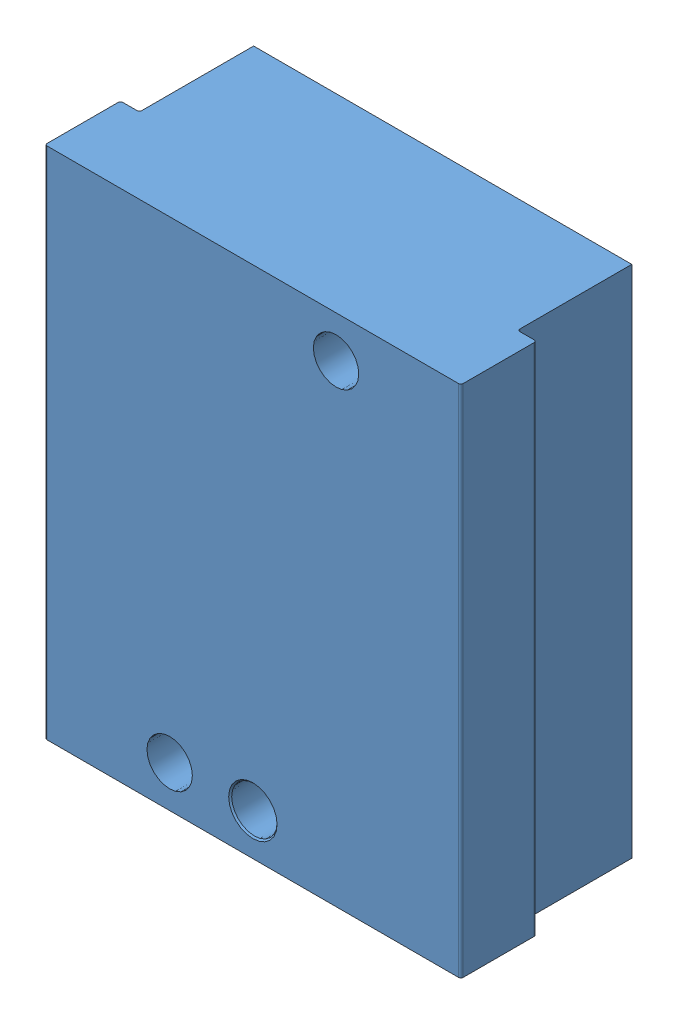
SolidWorks assembly empreinte éprouvette.SLDASM, configuration Défaut (file format 5000). Lengths in mm.
Overall size (55 68 25.1).
3 component instances, 2 part files, 6 mates.
Components (placement in the parent):
- empreinte mobile-1: empreinte mobile.SLDPRT [RAZ diagonale] at (-27.005 -53.0378 -43.6892) size (55 68 25.1)
- Eprouvette 3-1: Eprouvette 3.SLDPRT [Défaut] at (-38.005 -14.0378 -68.7892) (suppressed, hidden)
- Eprouvette 3-2: Eprouvette 3.SLDPRT [Défaut] at (-16.005 -14.0378 -67.2892) x (-1 0 0) z (0 0 -1) (suppressed, hidden)
Mates (geometry in assembly coordinates):
- Coïncidente7: coincident aligned: plane of empreinte mobile-1 through (-52.005 14.9622 -68.7892) normal (0 0 -1); plane of Eprouvette 3-1 through (-38.005 -14.0378 -68.7892) normal (0 0 -1)
- Distance1: distance = 1.5 mm anti-aligned: plane of empreinte mobile-1 through (-52.005 14.9622 -68.7892) normal (0 0 -1); plane of Eprouvette 3-2 through (-16.005 -14.0378 -67.2892) normal (0 0 1)
- Distance2: distance = 13.5 mm aligned: plane of Eprouvette 3-1 through (-41.005 -5.0378 -67.2892) normal (-1 0 0); plane of empreinte mobile-1 through (-54.505 14.9622 -53.6892) normal (-1 0 0)
- Distance3: distance = 13.5 mm aligned: plane of Eprouvette 3-2 through (-13.005 -5.0378 -68.7892) normal (1 0 0); plane of empreinte mobile-1 through (0.495 14.9622 -53.6892) normal (1 0 0)
- Distance4: distance = 13 mm aligned: plane of Eprouvette 3-1 through (-43.005 1.9622 -67.2892) normal (0 1 0); plane of empreinte mobile-1 through (-27.005 14.9622 -43.6892) normal (0 1 0)
- Distance5: distance = 13 mm aligned: plane of Eprouvette 3-2 through (-11.005 1.9622 -68.7892) normal (0 1 0); plane of empreinte mobile-1 through (-27.005 14.9622 -43.6892) normal (0 1 0)
